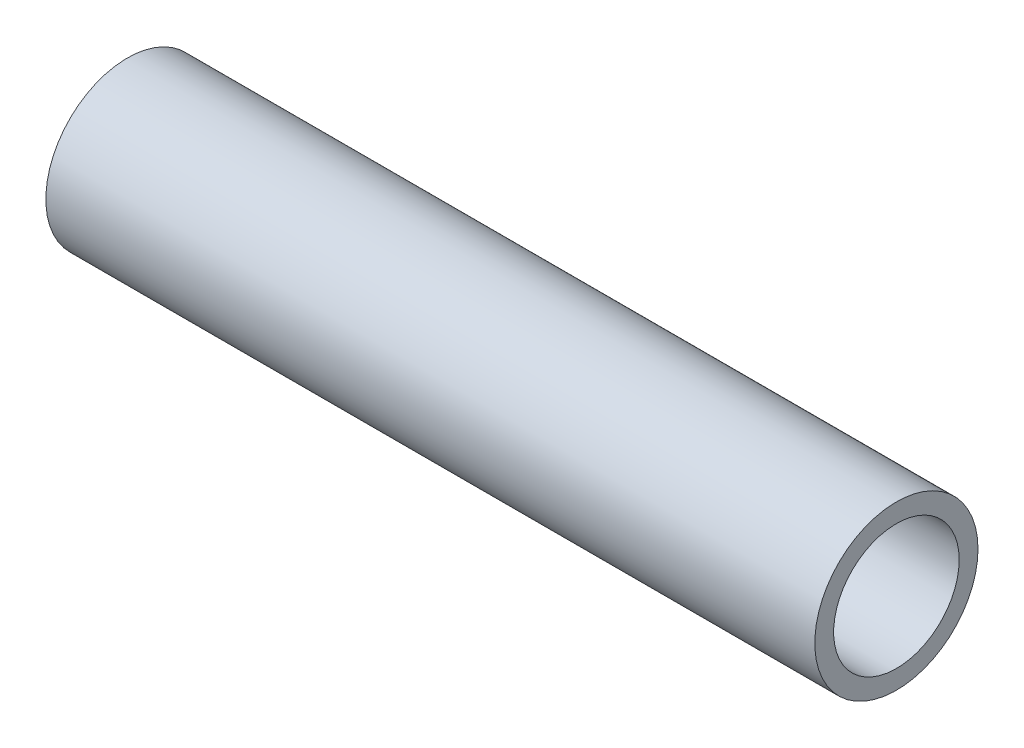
ISO-10303-21;
HEADER;
FILE_DESCRIPTION(('STEP AP214'),'2;1');
FILE_NAME('part.step','',(''),(''),'','','');
FILE_SCHEMA(('AUTOMOTIVE_DESIGN { 1 0 10303 214 1 1 1 1 }'));
ENDSEC;
DATA;
#1=APPLICATION_CONTEXT('core data for automotive mechanical design processes');
#2=APPLICATION_PROTOCOL_DEFINITION('international standard','automotive_design',2000,#1);
#3=PRODUCT_CONTEXT('',#1,'mechanical');
#4=PRODUCT('Part','Part','',(#3));
#5=PRODUCT_RELATED_PRODUCT_CATEGORY('part','',(#4));
#6=PRODUCT_DEFINITION_FORMATION('','',#4);
#7=PRODUCT_DEFINITION_CONTEXT('part definition',#1,'design');
#8=PRODUCT_DEFINITION('design','',#6,#7);
#9=PRODUCT_DEFINITION_SHAPE('','',#8);
#10=(LENGTH_UNIT() NAMED_UNIT(*) SI_UNIT(.MILLI.,.METRE.));
#11=(NAMED_UNIT(*) PLANE_ANGLE_UNIT() SI_UNIT($,.RADIAN.));
#12=(NAMED_UNIT(*) SI_UNIT($,.STERADIAN.) SOLID_ANGLE_UNIT());
#13=UNCERTAINTY_MEASURE_WITH_UNIT(LENGTH_MEASURE(1.E-05),#10,'distance_accuracy_value','');
#14=(GEOMETRIC_REPRESENTATION_CONTEXT(3) GLOBAL_UNCERTAINTY_ASSIGNED_CONTEXT((#13)) GLOBAL_UNIT_ASSIGNED_CONTEXT((#10,
#11,#12)) REPRESENTATION_CONTEXT('',''));
#15=CARTESIAN_POINT('',(0.,0.,0.));
#16=DIRECTION('',(0.,0.,1.));
#17=DIRECTION('',(1.,0.,0.));
#18=AXIS2_PLACEMENT_3D('',#15,#16,#17);
#19=CARTESIAN_POINT('',(155.575,0.,0.));
#20=DIRECTION('',(-1.,0.,0.));
#21=DIRECTION('',(0.,0.,1.));
#22=AXIS2_PLACEMENT_3D('',#19,#20,#21);
#23=CYLINDRICAL_SURFACE('',#22,12.7);
#24=CARTESIAN_POINT('',(155.575,0.,0.));
#25=DIRECTION('',(1.,0.,0.));
#26=DIRECTION('',(0.,0.,-1.));
#27=AXIS2_PLACEMENT_3D('',#24,#25,#26);
#28=CIRCLE('',#27,12.7);
#29=CARTESIAN_POINT('',(155.575,0.,-12.7));
#30=VERTEX_POINT('',#29);
#31=EDGE_CURVE('E45',#30,#30,#28,.T.);
#32=ORIENTED_EDGE('',*,*,#31,.T.);
#33=EDGE_LOOP('',(#32));
#34=FACE_BOUND('',#33,.T.);
#35=CARTESIAN_POINT('',(0.,0.,0.));
#36=DIRECTION('',(1.,0.,0.));
#37=DIRECTION('',(0.,0.,-1.));
#38=AXIS2_PLACEMENT_3D('',#35,#36,#37);
#39=CIRCLE('',#38,12.7);
#40=CARTESIAN_POINT('',(0.,0.,-12.7));
#41=VERTEX_POINT('',#40);
#42=EDGE_CURVE('E51',#41,#41,#39,.T.);
#43=ORIENTED_EDGE('',*,*,#42,.F.);
#44=EDGE_LOOP('',(#43));
#45=FACE_BOUND('',#44,.T.);
#46=ADVANCED_FACE('F38',(#34,#45),#23,.F.);
#47=CARTESIAN_POINT('',(155.575,0.,0.));
#48=DIRECTION('',(-1.,0.,0.));
#49=DIRECTION('',(0.,0.,1.));
#50=AXIS2_PLACEMENT_3D('',#47,#48,#49);
#51=CYLINDRICAL_SURFACE('',#50,16.51);
#52=CARTESIAN_POINT('',(155.575,0.,0.));
#53=DIRECTION('',(1.,0.,0.));
#54=DIRECTION('',(0.,0.,-1.));
#55=AXIS2_PLACEMENT_3D('',#52,#53,#54);
#56=CIRCLE('',#55,16.51);
#57=CARTESIAN_POINT('',(155.575,0.,-16.51));
#58=VERTEX_POINT('',#57);
#59=EDGE_CURVE('E10',#58,#58,#56,.T.);
#60=ORIENTED_EDGE('',*,*,#59,.F.);
#61=EDGE_LOOP('',(#60));
#62=FACE_BOUND('',#61,.T.);
#63=CARTESIAN_POINT('',(0.,0.,0.));
#64=DIRECTION('',(1.,0.,0.));
#65=DIRECTION('',(0.,0.,-1.));
#66=AXIS2_PLACEMENT_3D('',#63,#64,#65);
#67=CIRCLE('',#66,16.51);
#68=CARTESIAN_POINT('',(0.,0.,-16.51));
#69=VERTEX_POINT('',#68);
#70=EDGE_CURVE('E41',#69,#69,#67,.T.);
#71=ORIENTED_EDGE('',*,*,#70,.T.);
#72=EDGE_LOOP('',(#71));
#73=FACE_BOUND('',#72,.T.);
#74=ADVANCED_FACE('F58',(#62,#73),#51,.T.);
#75=CARTESIAN_POINT('',(155.575,0.,0.));
#76=DIRECTION('',(1.,0.,0.));
#77=DIRECTION('',(0.,0.,-1.));
#78=AXIS2_PLACEMENT_3D('',#75,#76,#77);
#79=PLANE('',#78);
#80=ORIENTED_EDGE('',*,*,#31,.F.);
#81=EDGE_LOOP('',(#80));
#82=FACE_BOUND('',#81,.T.);
#83=ORIENTED_EDGE('',*,*,#59,.T.);
#84=EDGE_LOOP('',(#83));
#85=FACE_BOUND('',#84,.T.);
#86=ADVANCED_FACE('F62',(#82,#85),#79,.T.);
#87=CARTESIAN_POINT('',(0.,0.,0.));
#88=DIRECTION('',(1.,0.,0.));
#89=DIRECTION('',(0.,0.,-1.));
#90=AXIS2_PLACEMENT_3D('',#87,#88,#89);
#91=PLANE('',#90);
#92=ORIENTED_EDGE('',*,*,#42,.T.);
#93=EDGE_LOOP('',(#92));
#94=FACE_BOUND('',#93,.T.);
#95=ORIENTED_EDGE('',*,*,#70,.F.);
#96=EDGE_LOOP('',(#95));
#97=FACE_BOUND('',#96,.T.);
#98=ADVANCED_FACE('F60',(#94,#97),#91,.F.);
#99=CLOSED_SHELL('',(#46,#74,#86,#98));
#100=MANIFOLD_SOLID_BREP('B2',#99);
#101=ADVANCED_BREP_SHAPE_REPRESENTATION('',(#18,#100),#14);
#102=SHAPE_DEFINITION_REPRESENTATION(#9,#101);
ENDSEC;
END-ISO-10303-21;
